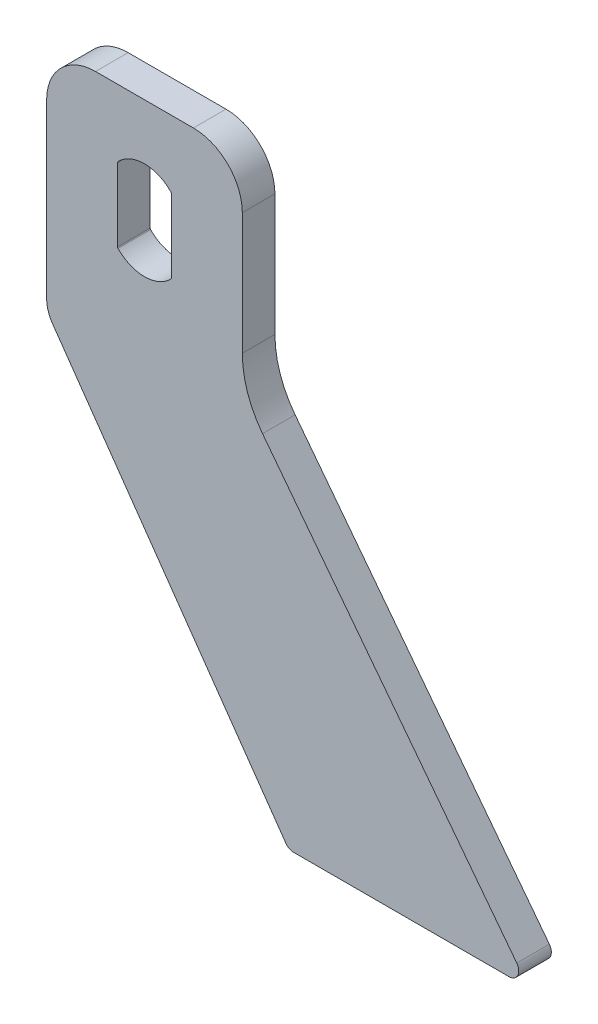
from build123d import *

# Parameters (mm, degrees)
EXTRUDE1_DEPTH = 10


with BuildPart() as part:
    # Sketch1 → Extrude1 (new body)
    with BuildSketch(Plane.XY):
        with BuildLine():
            Line((15, 32), (-15, 32))
            ThreePointArc((-15, 32), (-25.606601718, 27.606601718), (-30, 17))
            Line((-30, 17), (-30, -35.847012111))
            ThreePointArc((-30, -35.847012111), (-29.537169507, -38.854070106), (-28.191520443, -41.582776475))
            Line((-28.191520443, -41.582776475), (43.326244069, -143.720729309))
            ThreePointArc((43.326244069, -143.720729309), (44.398454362, -144.6610325), (45.783700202, -145))
            Line((45.783700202, -145), (111.775541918, -145))
            ThreePointArc((111.775541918, -145), (114.466160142, -143.326866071), (114.155601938, -140.173715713))
            Line((114.155601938, -140.173715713), (36.199399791, -38.579215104))
            ThreePointArc((36.199399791, -38.579215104), (31.592096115, -29.959556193), (30, -20.316372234))
            Line((30, -20.316372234), (30, 17))
            ThreePointArc((30, 17), (25.606601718, 27.606601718), (15, 32))
        make_face()
        with BuildLine():
            Line((8.25, -11.199832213), (8.25, 11.199832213))
            ThreePointArc((8.25, 11.199832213), (8.213806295, 11.386604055), (8.110465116, 11.546336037))
            ThreePointArc((8.110465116, 11.546336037), (0, 15), (-8.110465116, 11.546336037))
            ThreePointArc((-8.110465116, 11.546336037), (-8.213806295, 11.386604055), (-8.25, 11.199832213))
            Line((-8.25, 11.199832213), (-8.25, -11.199832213))
            ThreePointArc((-8.25, -11.199832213), (-8.213806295, -11.386604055), (-8.110465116, -11.546336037))
            ThreePointArc((-8.110465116, -11.546336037), (0, -15), (8.110465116, -11.546336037))
            ThreePointArc((8.110465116, -11.546336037), (8.213806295, -11.386604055), (8.25, -11.199832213))
        make_face(mode=Mode.SUBTRACT)
    extrude(amount=EXTRUDE1_DEPTH)


solid = part.part
